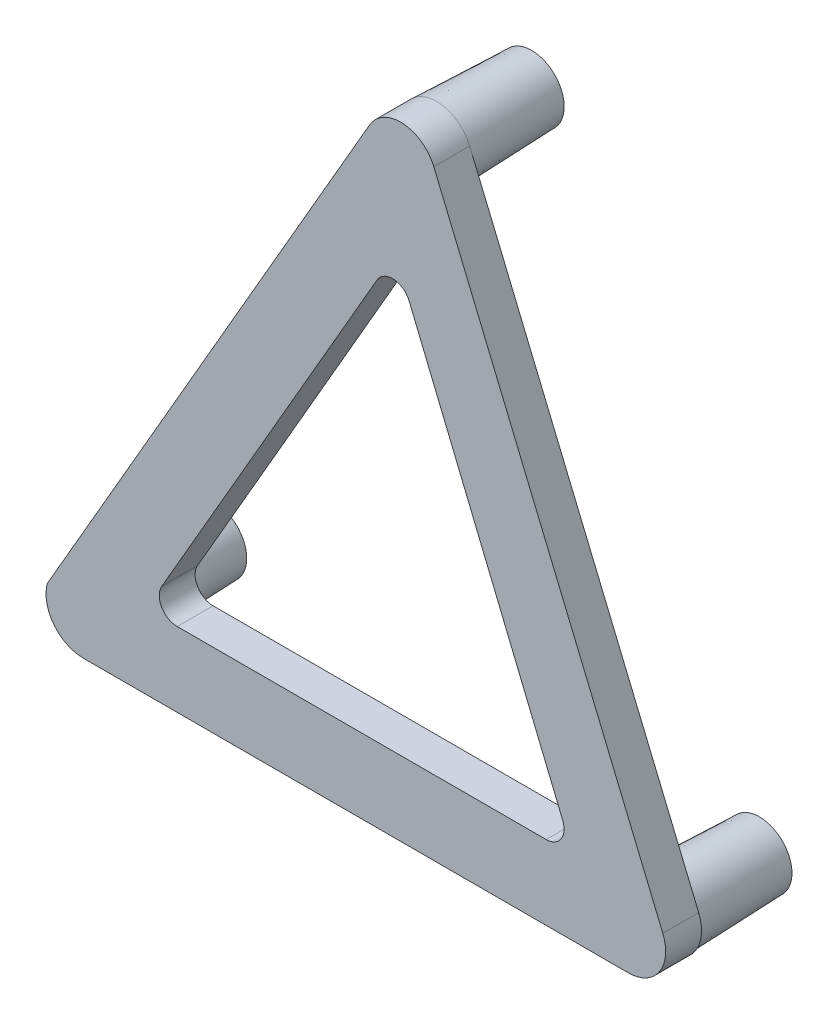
ISO-10303-21;
HEADER;
FILE_DESCRIPTION(('STEP AP214'),'2;1');
FILE_NAME('part.step','',(''),(''),'','','');
FILE_SCHEMA(('AUTOMOTIVE_DESIGN { 1 0 10303 214 1 1 1 1 }'));
ENDSEC;
DATA;
#1=APPLICATION_CONTEXT('core data for automotive mechanical design processes');
#2=APPLICATION_PROTOCOL_DEFINITION('international standard','automotive_design',2000,#1);
#3=PRODUCT_CONTEXT('',#1,'mechanical');
#4=PRODUCT('Part','Part','',(#3));
#5=PRODUCT_RELATED_PRODUCT_CATEGORY('part','',(#4));
#6=PRODUCT_DEFINITION_FORMATION('','',#4);
#7=PRODUCT_DEFINITION_CONTEXT('part definition',#1,'design');
#8=PRODUCT_DEFINITION('design','',#6,#7);
#9=PRODUCT_DEFINITION_SHAPE('','',#8);
#10=(LENGTH_UNIT() NAMED_UNIT(*) SI_UNIT(.MILLI.,.METRE.));
#11=(NAMED_UNIT(*) PLANE_ANGLE_UNIT() SI_UNIT($,.RADIAN.));
#12=(NAMED_UNIT(*) SI_UNIT($,.STERADIAN.) SOLID_ANGLE_UNIT());
#13=UNCERTAINTY_MEASURE_WITH_UNIT(LENGTH_MEASURE(1.E-05),#10,'distance_accuracy_value','');
#14=(GEOMETRIC_REPRESENTATION_CONTEXT(3) GLOBAL_UNCERTAINTY_ASSIGNED_CONTEXT((#13)) GLOBAL_UNIT_ASSIGNED_CONTEXT((#10,
#11,#12)) REPRESENTATION_CONTEXT('',''));
#15=CARTESIAN_POINT('',(0.,0.,0.));
#16=DIRECTION('',(0.,0.,1.));
#17=DIRECTION('',(1.,0.,0.));
#18=AXIS2_PLACEMENT_3D('',#15,#16,#17);
#19=CARTESIAN_POINT('',(17.6999999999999,30.6572992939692,2.));
#20=DIRECTION('',(0.,0.,1.));
#21=DIRECTION('',(1.,0.,0.));
#22=AXIS2_PLACEMENT_3D('',#19,#20,#21);
#23=PLANE('',#22);
#24=CARTESIAN_POINT('',(17.6999999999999,30.6572992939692,2.));
#25=DIRECTION('',(0.,0.,1.));
#26=DIRECTION('',(1.,0.,0.));
#27=AXIS2_PLACEMENT_3D('',#24,#25,#26);
#28=CIRCLE('',#27,2.);
#29=CARTESIAN_POINT('',(19.5460240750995,31.4268414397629,2.));
#30=VERTEX_POINT('',#29);
#31=CARTESIAN_POINT('',(15.967949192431,31.6572992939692,2.));
#32=VERTEX_POINT('',#31);
#33=EDGE_CURVE('E158',#30,#32,#28,.T.);
#34=ORIENTED_EDGE('',*,*,#33,.T.);
#35=DIRECTION('',(-0.499999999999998,-0.86602540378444,0.));
#36=VECTOR('',#35,1.);
#37=CARTESIAN_POINT('',(15.967949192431,31.6572992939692,2.));
#38=LINE('',#37,#36);
#39=CARTESIAN_POINT('',(-2.00618630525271,0.525183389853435,2.));
#40=VERTEX_POINT('',#39);
#41=EDGE_CURVE('E236',#32,#40,#38,.T.);
#42=ORIENTED_EDGE('',*,*,#41,.T.);
#43=CARTESIAN_POINT('',(0.,0.,2.));
#44=DIRECTION('',(0.,0.,1.));
#45=DIRECTION('',(1.,0.,0.));
#46=AXIS2_PLACEMENT_3D('',#43,#44,#45);
#47=CIRCLE('',#46,2.07378906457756);
#48=CARTESIAN_POINT('',(0.,-2.07378906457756,2.));
#49=VERTEX_POINT('',#48);
#50=EDGE_CURVE('E238',#40,#49,#47,.T.);
#51=ORIENTED_EDGE('',*,*,#50,.T.);
#52=DIRECTION('',(1.,0.,0.));
#53=VECTOR('',#52,1.);
#54=CARTESIAN_POINT('',(30.4,-2.07378906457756,2.));
#55=LINE('',#54,#53);
#56=CARTESIAN_POINT('',(30.4,-2.07378906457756,2.));
#57=VERTEX_POINT('',#56);
#58=EDGE_CURVE('E240',#49,#57,#55,.T.);
#59=ORIENTED_EDGE('',*,*,#58,.T.);
#60=CARTESIAN_POINT('',(30.4,0.,2.));
#61=DIRECTION('',(0.,0.,1.));
#62=DIRECTION('',(1.,0.,0.));
#63=AXIS2_PLACEMENT_3D('',#60,#61,#62);
#64=CIRCLE('',#63,2.07378906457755);
#65=CARTESIAN_POINT('',(32.3141322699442,0.797934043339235,2.));
#66=VERTEX_POINT('',#65);
#67=EDGE_CURVE('E167',#57,#66,#64,.T.);
#68=ORIENTED_EDGE('',*,*,#67,.T.);
#69=DIRECTION('',(-0.384771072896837,0.923012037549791,0.));
#70=VECTOR('',#69,1.);
#71=CARTESIAN_POINT('',(32.3141322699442,0.797934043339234,2.));
#72=LINE('',#71,#70);
#73=EDGE_CURVE('E163',#66,#30,#72,.T.);
#74=ORIENTED_EDGE('',*,*,#73,.T.);
#75=EDGE_LOOP('',(#34,#42,#51,#59,#68,#74));
#76=FACE_BOUND('',#75,.T.);
#77=DIRECTION('',(-0.380662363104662,0.924714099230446,0.));
#78=VECTOR('',#77,1.);
#79=CARTESIAN_POINT('',(27.3036889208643,2.07378906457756,2.));
#80=LINE('',#79,#78);
#81=CARTESIAN_POINT('',(26.7353335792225,3.45445142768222,2.));
#82=VERTEX_POINT('',#81);
#83=CARTESIAN_POINT('',(18.1726891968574,24.2550315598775,2.));
#84=VERTEX_POINT('',#83);
#85=EDGE_CURVE('E219',#82,#84,#80,.T.);
#86=ORIENTED_EDGE('',*,*,#85,.F.);
#87=CARTESIAN_POINT('',(25.810619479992,3.07378906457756,2.));
#88=DIRECTION('',(0.,0.,1.));
#89=DIRECTION('',(1.,0.,0.));
#90=AXIS2_PLACEMENT_3D('',#87,#88,#89);
#91=CIRCLE('',#90,1.);
#92=CARTESIAN_POINT('',(25.810619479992,2.07378906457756,2.));
#93=VERTEX_POINT('',#92);
#94=EDGE_CURVE('E198',#82,#93,#91,.F.);
#95=ORIENTED_EDGE('',*,*,#94,.T.);
#96=DIRECTION('',(1.,0.,0.));
#97=VECTOR('',#96,1.);
#98=CARTESIAN_POINT('',(27.3036889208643,2.07378906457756,2.));
#99=LINE('',#98,#97);
#100=CARTESIAN_POINT('',(5.23875455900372,2.07378906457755,2.));
#101=VERTEX_POINT('',#100);
#102=EDGE_CURVE('E214',#101,#93,#99,.T.);
#103=ORIENTED_EDGE('',*,*,#102,.F.);
#104=CARTESIAN_POINT('',(5.23875455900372,3.07378906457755,2.));
#105=DIRECTION('',(0.,0.,1.));
#106=DIRECTION('',(1.,0.,0.));
#107=AXIS2_PLACEMENT_3D('',#104,#105,#106);
#108=CIRCLE('',#107,1.);
#109=CARTESIAN_POINT('',(4.37272915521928,3.57378906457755,2.));
#110=VERTEX_POINT('',#109);
#111=EDGE_CURVE('E55',#101,#110,#108,.F.);
#112=ORIENTED_EDGE('',*,*,#111,.T.);
#113=DIRECTION('',(-0.499999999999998,-0.86602540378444,0.));
#114=VECTOR('',#113,1.);
#115=CARTESIAN_POINT('',(17.3986500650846,26.1353458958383,2.));
#116=LINE('',#115,#114);
#117=CARTESIAN_POINT('',(16.3819496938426,24.3743691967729,2.));
#118=VERTEX_POINT('',#117);
#119=EDGE_CURVE('E135',#118,#110,#116,.T.);
#120=ORIENTED_EDGE('',*,*,#119,.F.);
#121=CARTESIAN_POINT('',(17.247975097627,23.8743691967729,2.));
#122=DIRECTION('',(0.,0.,1.));
#123=DIRECTION('',(1.,0.,0.));
#124=AXIS2_PLACEMENT_3D('',#121,#122,#123);
#125=CIRCLE('',#124,1.);
#126=EDGE_CURVE('E11',#118,#84,#125,.F.);
#127=ORIENTED_EDGE('',*,*,#126,.T.);
#128=EDGE_LOOP('',(#86,#95,#103,#112,#120,#127));
#129=FACE_BOUND('',#128,.T.);
#130=ADVANCED_FACE('F35',(#76,#129),#23,.T.);
#131=CARTESIAN_POINT('',(17.6999999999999,30.6572992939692,0.));
#132=DIRECTION('',(0.,0.,1.));
#133=DIRECTION('',(1.,0.,0.));
#134=AXIS2_PLACEMENT_3D('',#131,#132,#133);
#135=PLANE('',#134);
#136=CARTESIAN_POINT('',(30.4,0.,0.));
#137=DIRECTION('',(0.,0.,1.));
#138=DIRECTION('',(1.,0.,0.));
#139=AXIS2_PLACEMENT_3D('',#136,#137,#138);
#140=CIRCLE('',#139,2.00000000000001);
#141=CARTESIAN_POINT('',(32.4,0.,0.));
#142=VERTEX_POINT('',#141);
#143=EDGE_CURVE('E267',#142,#142,#140,.T.);
#144=ORIENTED_EDGE('',*,*,#143,.T.);
#145=EDGE_LOOP('',(#144));
#146=FACE_BOUND('',#145,.T.);
#147=DIRECTION('',(-0.499999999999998,-0.86602540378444,0.));
#148=VECTOR('',#147,1.);
#149=CARTESIAN_POINT('',(15.967949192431,31.6572992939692,0.));
#150=LINE('',#149,#148);
#151=CARTESIAN_POINT('',(15.967949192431,31.6572992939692,0.));
#152=VERTEX_POINT('',#151);
#153=CARTESIAN_POINT('',(-1.73205080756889,0.999999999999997,0.));
#154=VERTEX_POINT('',#153);
#155=EDGE_CURVE('E145',#152,#154,#150,.T.);
#156=ORIENTED_EDGE('',*,*,#155,.F.);
#157=CARTESIAN_POINT('',(17.6999999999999,30.6572992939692,0.));
#158=DIRECTION('',(0.,0.,1.));
#159=DIRECTION('',(1.,0.,0.));
#160=AXIS2_PLACEMENT_3D('',#157,#158,#159);
#161=CIRCLE('',#160,2.00000000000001);
#162=CARTESIAN_POINT('',(19.5460240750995,31.4268414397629,0.));
#163=VERTEX_POINT('',#162);
#164=EDGE_CURVE('E129',#152,#163,#161,.T.);
#165=ORIENTED_EDGE('',*,*,#164,.T.);
#166=DIRECTION('',(-0.384771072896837,0.923012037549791,0.));
#167=VECTOR('',#166,1.);
#168=CARTESIAN_POINT('',(32.3141322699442,0.797934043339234,0.));
#169=LINE('',#168,#167);
#170=CARTESIAN_POINT('',(32.3141322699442,0.797934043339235,0.));
#171=VERTEX_POINT('',#170);
#172=EDGE_CURVE('E143',#171,#163,#169,.T.);
#173=ORIENTED_EDGE('',*,*,#172,.F.);
#174=CARTESIAN_POINT('',(30.4,0.,0.));
#175=DIRECTION('',(0.,0.,1.));
#176=DIRECTION('',(1.,0.,0.));
#177=AXIS2_PLACEMENT_3D('',#174,#175,#176);
#178=CIRCLE('',#177,2.07378906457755);
#179=CARTESIAN_POINT('',(30.4,-2.07378906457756,0.));
#180=VERTEX_POINT('',#179);
#181=EDGE_CURVE('E159',#180,#171,#178,.T.);
#182=ORIENTED_EDGE('',*,*,#181,.F.);
#183=DIRECTION('',(1.,0.,0.));
#184=VECTOR('',#183,1.);
#185=CARTESIAN_POINT('',(30.4,-2.07378906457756,0.));
#186=LINE('',#185,#184);
#187=CARTESIAN_POINT('',(0.,-2.07378906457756,0.));
#188=VERTEX_POINT('',#187);
#189=EDGE_CURVE('E246',#188,#180,#186,.T.);
#190=ORIENTED_EDGE('',*,*,#189,.F.);
#191=CARTESIAN_POINT('',(0.,0.,0.));
#192=DIRECTION('',(0.,0.,1.));
#193=DIRECTION('',(1.,0.,0.));
#194=AXIS2_PLACEMENT_3D('',#191,#192,#193);
#195=CIRCLE('',#194,2.07378906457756);
#196=CARTESIAN_POINT('',(-2.00618630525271,0.525183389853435,0.));
#197=VERTEX_POINT('',#196);
#198=EDGE_CURVE('E244',#197,#188,#195,.T.);
#199=ORIENTED_EDGE('',*,*,#198,.F.);
#200=EDGE_CURVE('E134',#154,#197,#150,.T.);
#201=ORIENTED_EDGE('',*,*,#200,.F.);
#202=CARTESIAN_POINT('',(0.,0.,0.));
#203=DIRECTION('',(0.,0.,1.));
#204=DIRECTION('',(1.,0.,0.));
#205=AXIS2_PLACEMENT_3D('',#202,#203,#204);
#206=CIRCLE('',#205,2.);
#207=EDGE_CURVE('E48',#154,#154,#206,.T.);
#208=ORIENTED_EDGE('',*,*,#207,.T.);
#209=EDGE_LOOP('',(#156,#165,#173,#182,#190,#199,#201,#208));
#210=FACE_BOUND('',#209,.T.);
#211=DIRECTION('',(-0.499999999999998,-0.86602540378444,0.));
#212=VECTOR('',#211,1.);
#213=CARTESIAN_POINT('',(17.3986500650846,26.1353458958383,0.));
#214=LINE('',#213,#212);
#215=CARTESIAN_POINT('',(16.3819496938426,24.3743691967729,0.));
#216=VERTEX_POINT('',#215);
#217=CARTESIAN_POINT('',(4.37272915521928,3.57378906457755,0.));
#218=VERTEX_POINT('',#217);
#219=EDGE_CURVE('E205',#216,#218,#214,.T.);
#220=ORIENTED_EDGE('',*,*,#219,.T.);
#221=CARTESIAN_POINT('',(5.23875455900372,3.07378906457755,0.));
#222=DIRECTION('',(0.,0.,1.));
#223=DIRECTION('',(1.,0.,0.));
#224=AXIS2_PLACEMENT_3D('',#221,#222,#223);
#225=CIRCLE('',#224,1.);
#226=CARTESIAN_POINT('',(5.23875455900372,2.07378906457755,0.));
#227=VERTEX_POINT('',#226);
#228=EDGE_CURVE('E200',#218,#227,#225,.T.);
#229=ORIENTED_EDGE('',*,*,#228,.T.);
#230=DIRECTION('',(1.,0.,0.));
#231=VECTOR('',#230,1.);
#232=CARTESIAN_POINT('',(27.3036889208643,2.07378906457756,0.));
#233=LINE('',#232,#231);
#234=CARTESIAN_POINT('',(25.810619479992,2.07378906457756,0.));
#235=VERTEX_POINT('',#234);
#236=EDGE_CURVE('E230',#227,#235,#233,.T.);
#237=ORIENTED_EDGE('',*,*,#236,.T.);
#238=CARTESIAN_POINT('',(25.810619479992,3.07378906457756,0.));
#239=DIRECTION('',(0.,0.,1.));
#240=DIRECTION('',(1.,0.,0.));
#241=AXIS2_PLACEMENT_3D('',#238,#239,#240);
#242=CIRCLE('',#241,1.);
#243=CARTESIAN_POINT('',(26.7353335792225,3.45445142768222,0.));
#244=VERTEX_POINT('',#243);
#245=EDGE_CURVE('E196',#235,#244,#242,.T.);
#246=ORIENTED_EDGE('',*,*,#245,.T.);
#247=DIRECTION('',(-0.380662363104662,0.924714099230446,0.));
#248=VECTOR('',#247,1.);
#249=CARTESIAN_POINT('',(27.3036889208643,2.07378906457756,0.));
#250=LINE('',#249,#248);
#251=CARTESIAN_POINT('',(18.1726891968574,24.2550315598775,0.));
#252=VERTEX_POINT('',#251);
#253=EDGE_CURVE('E207',#244,#252,#250,.T.);
#254=ORIENTED_EDGE('',*,*,#253,.T.);
#255=CARTESIAN_POINT('',(17.247975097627,23.8743691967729,0.));
#256=DIRECTION('',(0.,0.,1.));
#257=DIRECTION('',(1.,0.,0.));
#258=AXIS2_PLACEMENT_3D('',#255,#256,#257);
#259=CIRCLE('',#258,1.);
#260=EDGE_CURVE('E43',#252,#216,#259,.T.);
#261=ORIENTED_EDGE('',*,*,#260,.T.);
#262=EDGE_LOOP('',(#220,#229,#237,#246,#254,#261));
#263=FACE_BOUND('',#262,.T.);
#264=ADVANCED_FACE('F140',(#146,#210,#263),#135,.F.);
#265=CARTESIAN_POINT('',(17.6999999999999,30.6572992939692,2.));
#266=DIRECTION('',(0.,0.,-1.));
#267=DIRECTION('',(-1.,0.,0.));
#268=AXIS2_PLACEMENT_3D('',#265,#266,#267);
#269=CYLINDRICAL_SURFACE('',#268,2.);
#270=CARTESIAN_POINT('',(17.6999999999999,30.6572992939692,0.));
#271=DIRECTION('',(0.,0.,1.));
#272=DIRECTION('',(1.,0.,0.));
#273=AXIS2_PLACEMENT_3D('',#270,#271,#272);
#274=CIRCLE('',#273,2.);
#275=EDGE_CURVE('E126',#163,#152,#274,.T.);
#276=ORIENTED_EDGE('',*,*,#275,.T.);
#277=DIRECTION('',(0.,0.,-1.));
#278=VECTOR('',#277,1.);
#279=CARTESIAN_POINT('',(15.967949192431,31.6572992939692,2.));
#280=LINE('',#279,#278);
#281=EDGE_CURVE('E179',#32,#152,#280,.T.);
#282=ORIENTED_EDGE('',*,*,#281,.F.);
#283=ORIENTED_EDGE('',*,*,#33,.F.);
#284=DIRECTION('',(0.,0.,-1.));
#285=VECTOR('',#284,1.);
#286=CARTESIAN_POINT('',(19.5460240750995,31.4268414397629,2.));
#287=LINE('',#286,#285);
#288=EDGE_CURVE('E154',#30,#163,#287,.T.);
#289=ORIENTED_EDGE('',*,*,#288,.T.);
#290=EDGE_LOOP('',(#276,#282,#283,#289));
#291=FACE_BOUND('',#290,.T.);
#292=ADVANCED_FACE('F161',(#291),#269,.T.);
#293=CARTESIAN_POINT('',(15.967949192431,31.6572992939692,2.));
#294=DIRECTION('',(0.86602540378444,-0.499999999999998,0.));
#295=DIRECTION('',(0.499999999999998,0.86602540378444,0.));
#296=AXIS2_PLACEMENT_3D('',#293,#294,#295);
#297=PLANE('',#296);
#298=ORIENTED_EDGE('',*,*,#155,.T.);
#299=ORIENTED_EDGE('',*,*,#200,.T.);
#300=DIRECTION('',(0.,0.,-1.));
#301=VECTOR('',#300,1.);
#302=CARTESIAN_POINT('',(-2.00618630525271,0.525183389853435,2.));
#303=LINE('',#302,#301);
#304=EDGE_CURVE('E176',#40,#197,#303,.T.);
#305=ORIENTED_EDGE('',*,*,#304,.F.);
#306=ORIENTED_EDGE('',*,*,#41,.F.);
#307=ORIENTED_EDGE('',*,*,#281,.T.);
#308=EDGE_LOOP('',(#298,#299,#305,#306,#307));
#309=FACE_BOUND('',#308,.T.);
#310=ADVANCED_FACE('F263',(#309),#297,.F.);
#311=CARTESIAN_POINT('',(0.,0.,2.));
#312=DIRECTION('',(0.,0.,-1.));
#313=DIRECTION('',(-1.,0.,0.));
#314=AXIS2_PLACEMENT_3D('',#311,#312,#313);
#315=CYLINDRICAL_SURFACE('',#314,2.07378906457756);
#316=ORIENTED_EDGE('',*,*,#198,.T.);
#317=DIRECTION('',(0.,0.,-1.));
#318=VECTOR('',#317,1.);
#319=CARTESIAN_POINT('',(0.,-2.07378906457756,2.));
#320=LINE('',#319,#318);
#321=EDGE_CURVE('E173',#49,#188,#320,.T.);
#322=ORIENTED_EDGE('',*,*,#321,.F.);
#323=ORIENTED_EDGE('',*,*,#50,.F.);
#324=ORIENTED_EDGE('',*,*,#304,.T.);
#325=EDGE_LOOP('',(#316,#322,#323,#324));
#326=FACE_BOUND('',#325,.T.);
#327=ADVANCED_FACE('F260',(#326),#315,.T.);
#328=CARTESIAN_POINT('',(30.4,-2.07378906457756,2.));
#329=DIRECTION('',(0.,1.,0.));
#330=DIRECTION('',(-1.,0.,0.));
#331=AXIS2_PLACEMENT_3D('',#328,#329,#330);
#332=PLANE('',#331);
#333=ORIENTED_EDGE('',*,*,#189,.T.);
#334=DIRECTION('',(0.,0.,-1.));
#335=VECTOR('',#334,1.);
#336=CARTESIAN_POINT('',(30.4,-2.07378906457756,2.));
#337=LINE('',#336,#335);
#338=EDGE_CURVE('E165',#57,#180,#337,.T.);
#339=ORIENTED_EDGE('',*,*,#338,.F.);
#340=ORIENTED_EDGE('',*,*,#58,.F.);
#341=ORIENTED_EDGE('',*,*,#321,.T.);
#342=EDGE_LOOP('',(#333,#339,#340,#341));
#343=FACE_BOUND('',#342,.T.);
#344=ADVANCED_FACE('F255',(#343),#332,.F.);
#345=CARTESIAN_POINT('',(30.4,0.,2.));
#346=DIRECTION('',(0.,0.,-1.));
#347=DIRECTION('',(-1.,0.,0.));
#348=AXIS2_PLACEMENT_3D('',#345,#346,#347);
#349=CYLINDRICAL_SURFACE('',#348,2.07378906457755);
#350=ORIENTED_EDGE('',*,*,#181,.T.);
#351=DIRECTION('',(0.,0.,-1.));
#352=VECTOR('',#351,1.);
#353=CARTESIAN_POINT('',(32.3141322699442,0.797934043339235,2.));
#354=LINE('',#353,#352);
#355=EDGE_CURVE('E157',#66,#171,#354,.T.);
#356=ORIENTED_EDGE('',*,*,#355,.F.);
#357=ORIENTED_EDGE('',*,*,#67,.F.);
#358=ORIENTED_EDGE('',*,*,#338,.T.);
#359=EDGE_LOOP('',(#350,#356,#357,#358));
#360=FACE_BOUND('',#359,.T.);
#361=ADVANCED_FACE('F248',(#360),#349,.T.);
#362=CARTESIAN_POINT('',(32.3141322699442,0.797934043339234,2.));
#363=DIRECTION('',(-0.923012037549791,-0.384771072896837,0.));
#364=DIRECTION('',(0.384771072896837,-0.923012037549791,0.));
#365=AXIS2_PLACEMENT_3D('',#362,#363,#364);
#366=PLANE('',#365);
#367=ORIENTED_EDGE('',*,*,#172,.T.);
#368=ORIENTED_EDGE('',*,*,#288,.F.);
#369=ORIENTED_EDGE('',*,*,#73,.F.);
#370=ORIENTED_EDGE('',*,*,#355,.T.);
#371=EDGE_LOOP('',(#367,#368,#369,#370));
#372=FACE_BOUND('',#371,.T.);
#373=ADVANCED_FACE('F152',(#372),#366,.F.);
#374=CARTESIAN_POINT('',(27.3036889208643,2.07378906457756,2.));
#375=DIRECTION('',(0.,1.,0.));
#376=DIRECTION('',(-1.,0.,0.));
#377=AXIS2_PLACEMENT_3D('',#374,#375,#376);
#378=PLANE('',#377);
#379=ORIENTED_EDGE('',*,*,#102,.T.);
#380=DIRECTION('',(0.,0.,-1.));
#381=VECTOR('',#380,1.);
#382=CARTESIAN_POINT('',(25.810619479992,2.07378906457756,0.));
#383=LINE('',#382,#381);
#384=EDGE_CURVE('E183',#93,#235,#383,.T.);
#385=ORIENTED_EDGE('',*,*,#384,.T.);
#386=ORIENTED_EDGE('',*,*,#236,.F.);
#387=DIRECTION('',(0.,0.,-1.));
#388=VECTOR('',#387,1.);
#389=CARTESIAN_POINT('',(5.23875455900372,2.07378906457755,2.));
#390=LINE('',#389,#388);
#391=EDGE_CURVE('E181',#227,#101,#390,.F.);
#392=ORIENTED_EDGE('',*,*,#391,.T.);
#393=EDGE_LOOP('',(#379,#385,#386,#392));
#394=FACE_BOUND('',#393,.T.);
#395=ADVANCED_FACE('F300',(#394),#378,.T.);
#396=CARTESIAN_POINT('',(27.3036889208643,2.07378906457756,2.));
#397=DIRECTION('',(-0.924714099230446,-0.380662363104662,0.));
#398=DIRECTION('',(0.380662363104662,-0.924714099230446,0.));
#399=AXIS2_PLACEMENT_3D('',#396,#397,#398);
#400=PLANE('',#399);
#401=ORIENTED_EDGE('',*,*,#253,.F.);
#402=DIRECTION('',(0.,0.,-1.));
#403=VECTOR('',#402,1.);
#404=CARTESIAN_POINT('',(26.7353335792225,3.45445142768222,2.));
#405=LINE('',#404,#403);
#406=EDGE_CURVE('E189',#244,#82,#405,.F.);
#407=ORIENTED_EDGE('',*,*,#406,.T.);
#408=ORIENTED_EDGE('',*,*,#85,.T.);
#409=DIRECTION('',(0.,0.,-1.));
#410=VECTOR('',#409,1.);
#411=CARTESIAN_POINT('',(18.1726891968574,24.2550315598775,0.));
#412=LINE('',#411,#410);
#413=EDGE_CURVE('E186',#84,#252,#412,.T.);
#414=ORIENTED_EDGE('',*,*,#413,.T.);
#415=EDGE_LOOP('',(#401,#407,#408,#414));
#416=FACE_BOUND('',#415,.T.);
#417=ADVANCED_FACE('F222',(#416),#400,.T.);
#418=CARTESIAN_POINT('',(17.3986500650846,26.1353458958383,2.));
#419=DIRECTION('',(0.86602540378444,-0.499999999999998,0.));
#420=DIRECTION('',(0.499999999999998,0.86602540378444,0.));
#421=AXIS2_PLACEMENT_3D('',#418,#419,#420);
#422=PLANE('',#421);
#423=ORIENTED_EDGE('',*,*,#119,.T.);
#424=DIRECTION('',(0.,0.,-1.));
#425=VECTOR('',#424,1.);
#426=CARTESIAN_POINT('',(4.37272915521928,3.57378906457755,0.));
#427=LINE('',#426,#425);
#428=EDGE_CURVE('E193',#110,#218,#427,.T.);
#429=ORIENTED_EDGE('',*,*,#428,.T.);
#430=ORIENTED_EDGE('',*,*,#219,.F.);
#431=DIRECTION('',(0.,0.,-1.));
#432=VECTOR('',#431,1.);
#433=CARTESIAN_POINT('',(16.3819496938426,24.3743691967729,2.));
#434=LINE('',#433,#432);
#435=EDGE_CURVE('E191',#216,#118,#434,.F.);
#436=ORIENTED_EDGE('',*,*,#435,.T.);
#437=EDGE_LOOP('',(#423,#429,#430,#436));
#438=FACE_BOUND('',#437,.T.);
#439=ADVANCED_FACE('F212',(#438),#422,.T.);
#440=CARTESIAN_POINT('',(25.810619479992,3.07378906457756,2.));
#441=DIRECTION('',(0.,0.,1.));
#442=DIRECTION('',(1.,0.,0.));
#443=AXIS2_PLACEMENT_3D('',#440,#441,#442);
#444=CYLINDRICAL_SURFACE('',#443,1.);
#445=ORIENTED_EDGE('',*,*,#94,.F.);
#446=ORIENTED_EDGE('',*,*,#406,.F.);
#447=ORIENTED_EDGE('',*,*,#245,.F.);
#448=ORIENTED_EDGE('',*,*,#384,.F.);
#449=EDGE_LOOP('',(#445,#446,#447,#448));
#450=FACE_BOUND('',#449,.T.);
#451=ADVANCED_FACE('F315',(#450),#444,.F.);
#452=CARTESIAN_POINT('',(5.23875455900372,3.07378906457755,2.));
#453=DIRECTION('',(0.,0.,1.));
#454=DIRECTION('',(1.,0.,0.));
#455=AXIS2_PLACEMENT_3D('',#452,#453,#454);
#456=CYLINDRICAL_SURFACE('',#455,1.);
#457=ORIENTED_EDGE('',*,*,#111,.F.);
#458=ORIENTED_EDGE('',*,*,#391,.F.);
#459=ORIENTED_EDGE('',*,*,#228,.F.);
#460=ORIENTED_EDGE('',*,*,#428,.F.);
#461=EDGE_LOOP('',(#457,#458,#459,#460));
#462=FACE_BOUND('',#461,.T.);
#463=ADVANCED_FACE('F317',(#462),#456,.F.);
#464=CARTESIAN_POINT('',(17.247975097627,23.8743691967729,2.));
#465=DIRECTION('',(0.,0.,1.));
#466=DIRECTION('',(1.,0.,0.));
#467=AXIS2_PLACEMENT_3D('',#464,#465,#466);
#468=CYLINDRICAL_SURFACE('',#467,1.);
#469=ORIENTED_EDGE('',*,*,#126,.F.);
#470=ORIENTED_EDGE('',*,*,#435,.F.);
#471=ORIENTED_EDGE('',*,*,#260,.F.);
#472=ORIENTED_EDGE('',*,*,#413,.F.);
#473=EDGE_LOOP('',(#469,#470,#471,#472));
#474=FACE_BOUND('',#473,.T.);
#475=ADVANCED_FACE('F37',(#474),#468,.F.);
#476=CARTESIAN_POINT('',(30.4,0.,0.));
#477=DIRECTION('',(0.,0.,1.));
#478=DIRECTION('',(1.,0.,0.));
#479=AXIS2_PLACEMENT_3D('',#476,#477,#478);
#480=CONICAL_SURFACE('',#479,2.00000000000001,0.0349065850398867);
#481=CARTESIAN_POINT('',(30.4,0.,-5.3));
#482=DIRECTION('',(0.,0.,1.));
#483=DIRECTION('',(1.,0.,0.));
#484=AXIS2_PLACEMENT_3D('',#481,#482,#483);
#485=CIRCLE('',#484,1.81491992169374);
#486=CARTESIAN_POINT('',(32.2149199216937,0.,-5.3));
#487=VERTEX_POINT('',#486);
#488=EDGE_CURVE('E233',#487,#487,#485,.T.);
#489=ORIENTED_EDGE('',*,*,#488,.T.);
#490=EDGE_LOOP('',(#489));
#491=FACE_BOUND('',#490,.T.);
#492=ORIENTED_EDGE('',*,*,#143,.F.);
#493=EDGE_LOOP('',(#492));
#494=FACE_BOUND('',#493,.T.);
#495=ADVANCED_FACE('F276',(#491,#494),#480,.T.);
#496=CARTESIAN_POINT('',(30.4,0.,-5.3));
#497=DIRECTION('',(0.,0.,1.));
#498=DIRECTION('',(1.,0.,0.));
#499=AXIS2_PLACEMENT_3D('',#496,#497,#498);
#500=PLANE('',#499);
#501=ORIENTED_EDGE('',*,*,#488,.F.);
#502=EDGE_LOOP('',(#501));
#503=FACE_BOUND('',#502,.T.);
#504=ADVANCED_FACE('F279',(#503),#500,.F.);
#505=CARTESIAN_POINT('',(0.,0.,0.));
#506=DIRECTION('',(0.,0.,1.));
#507=DIRECTION('',(1.,0.,0.));
#508=AXIS2_PLACEMENT_3D('',#505,#506,#507);
#509=CONICAL_SURFACE('',#508,2.,0.0349065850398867);
#510=CARTESIAN_POINT('',(0.,0.,-5.3));
#511=DIRECTION('',(0.,0.,1.));
#512=DIRECTION('',(1.,0.,0.));
#513=AXIS2_PLACEMENT_3D('',#510,#511,#512);
#514=CIRCLE('',#513,1.81491992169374);
#515=CARTESIAN_POINT('',(1.81491992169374,0.,-5.3));
#516=VERTEX_POINT('',#515);
#517=EDGE_CURVE('E264',#516,#516,#514,.T.);
#518=ORIENTED_EDGE('',*,*,#517,.T.);
#519=EDGE_LOOP('',(#518));
#520=FACE_BOUND('',#519,.T.);
#521=ORIENTED_EDGE('',*,*,#207,.F.);
#522=EDGE_LOOP('',(#521));
#523=FACE_BOUND('',#522,.T.);
#524=ADVANCED_FACE('F281',(#520,#523),#509,.T.);
#525=CARTESIAN_POINT('',(0.,0.,-5.3));
#526=DIRECTION('',(0.,0.,1.));
#527=DIRECTION('',(1.,0.,0.));
#528=AXIS2_PLACEMENT_3D('',#525,#526,#527);
#529=PLANE('',#528);
#530=ORIENTED_EDGE('',*,*,#517,.F.);
#531=EDGE_LOOP('',(#530));
#532=FACE_BOUND('',#531,.T.);
#533=ADVANCED_FACE('F287',(#532),#529,.F.);
#534=CARTESIAN_POINT('',(17.6999999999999,30.6572992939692,0.));
#535=DIRECTION('',(0.,0.,1.));
#536=DIRECTION('',(1.,0.,0.));
#537=AXIS2_PLACEMENT_3D('',#534,#535,#536);
#538=CONICAL_SURFACE('',#537,2.00000000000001,0.0349065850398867);
#539=CARTESIAN_POINT('',(17.6999999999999,30.6572992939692,-5.3));
#540=DIRECTION('',(0.,0.,1.));
#541=DIRECTION('',(1.,0.,0.));
#542=AXIS2_PLACEMENT_3D('',#539,#540,#541);
#543=CIRCLE('',#542,1.81491992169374);
#544=CARTESIAN_POINT('',(19.5149199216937,30.6572992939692,-5.3));
#545=VERTEX_POINT('',#544);
#546=EDGE_CURVE('E147',#545,#545,#543,.T.);
#547=ORIENTED_EDGE('',*,*,#546,.T.);
#548=EDGE_LOOP('',(#547));
#549=FACE_BOUND('',#548,.T.);
#550=ORIENTED_EDGE('',*,*,#275,.F.);
#551=ORIENTED_EDGE('',*,*,#164,.F.);
#552=EDGE_LOOP('',(#550,#551));
#553=FACE_BOUND('',#552,.T.);
#554=ADVANCED_FACE('F128',(#549,#553),#538,.T.);
#555=CARTESIAN_POINT('',(17.6999999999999,30.6572992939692,-5.3));
#556=DIRECTION('',(0.,0.,1.));
#557=DIRECTION('',(1.,0.,0.));
#558=AXIS2_PLACEMENT_3D('',#555,#556,#557);
#559=PLANE('',#558);
#560=ORIENTED_EDGE('',*,*,#546,.F.);
#561=EDGE_LOOP('',(#560));
#562=FACE_BOUND('',#561,.T.);
#563=ADVANCED_FACE('F414',(#562),#559,.F.);
#564=CLOSED_SHELL('',(#130,#264,#292,#310,#327,#344,#361,#373,#395,#417,#439,#451,#463,#475,
#495,#504,#524,#533,#554,#563));
#565=MANIFOLD_SOLID_BREP('B2',#564);
#566=ADVANCED_BREP_SHAPE_REPRESENTATION('',(#18,#565),#14);
#567=SHAPE_DEFINITION_REPRESENTATION(#9,#566);
ENDSEC;
END-ISO-10303-21;
